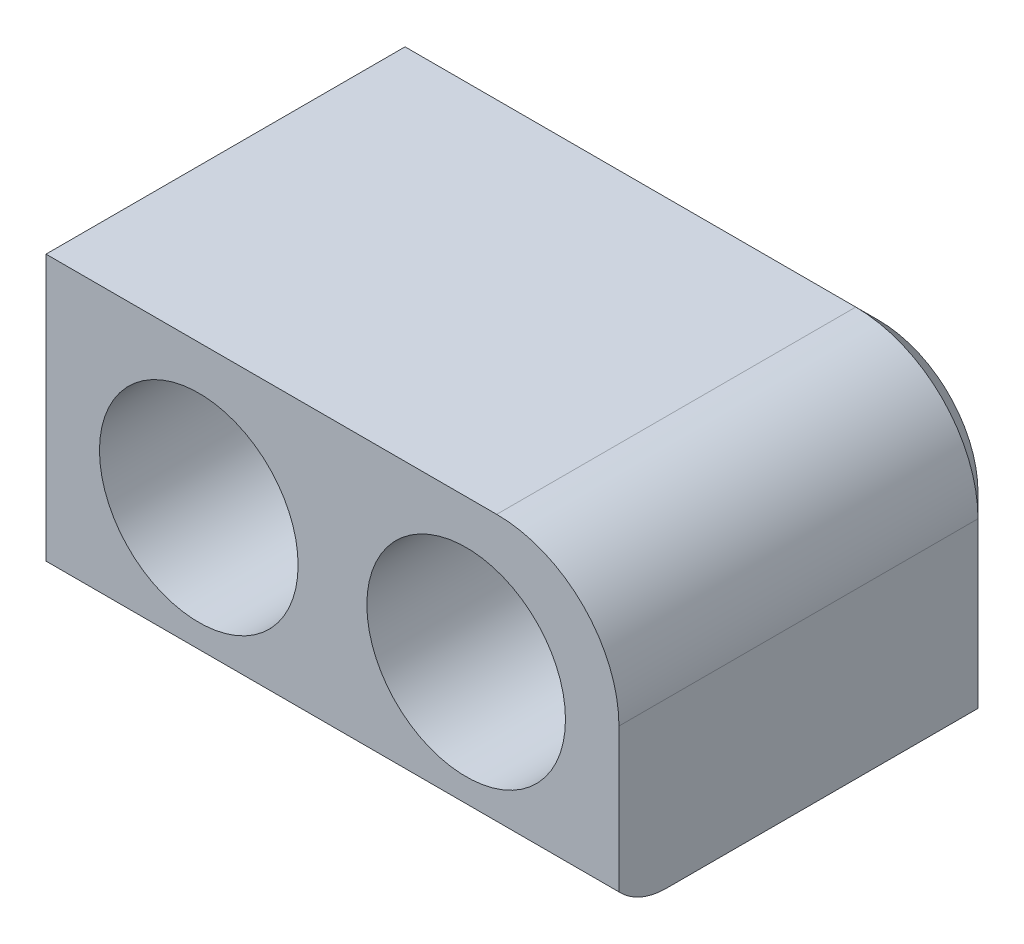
ISO-10303-21;
HEADER;
FILE_DESCRIPTION(('STEP AP214'),'2;1');
FILE_NAME('part.step','',(''),(''),'','','');
FILE_SCHEMA(('AUTOMOTIVE_DESIGN { 1 0 10303 214 1 1 1 1 }'));
ENDSEC;
DATA;
#1=APPLICATION_CONTEXT('core data for automotive mechanical design processes');
#2=APPLICATION_PROTOCOL_DEFINITION('international standard','automotive_design',2000,#1);
#3=PRODUCT_CONTEXT('',#1,'mechanical');
#4=PRODUCT('Part','Part','',(#3));
#5=PRODUCT_RELATED_PRODUCT_CATEGORY('part','',(#4));
#6=PRODUCT_DEFINITION_FORMATION('','',#4);
#7=PRODUCT_DEFINITION_CONTEXT('part definition',#1,'design');
#8=PRODUCT_DEFINITION('design','',#6,#7);
#9=PRODUCT_DEFINITION_SHAPE('','',#8);
#10=(LENGTH_UNIT() NAMED_UNIT(*) SI_UNIT(.MILLI.,.METRE.));
#11=(NAMED_UNIT(*) PLANE_ANGLE_UNIT() SI_UNIT($,.RADIAN.));
#12=(NAMED_UNIT(*) SI_UNIT($,.STERADIAN.) SOLID_ANGLE_UNIT());
#13=UNCERTAINTY_MEASURE_WITH_UNIT(LENGTH_MEASURE(1.E-05),#10,'distance_accuracy_value','');
#14=(GEOMETRIC_REPRESENTATION_CONTEXT(3) GLOBAL_UNCERTAINTY_ASSIGNED_CONTEXT((#13)) GLOBAL_UNIT_ASSIGNED_CONTEXT((#10,
#11,#12)) REPRESENTATION_CONTEXT('',''));
#15=CARTESIAN_POINT('',(0.,0.,0.));
#16=DIRECTION('',(0.,0.,1.));
#17=DIRECTION('',(1.,0.,0.));
#18=AXIS2_PLACEMENT_3D('',#15,#16,#17);
#19=CARTESIAN_POINT('',(0.,9.525,-12.7));
#20=DIRECTION('',(-1.,0.,0.));
#21=DIRECTION('',(0.,-1.,0.));
#22=AXIS2_PLACEMENT_3D('',#19,#20,#21);
#23=PLANE('',#22);
#24=DIRECTION('',(0.,0.,1.));
#25=VECTOR('',#24,1.);
#26=CARTESIAN_POINT('',(0.,9.525,-12.7));
#27=LINE('',#26,#25);
#28=CARTESIAN_POINT('',(0.,9.525,-11.938));
#29=VERTEX_POINT('',#28);
#30=CARTESIAN_POINT('',(0.,9.525,0.));
#31=VERTEX_POINT('',#30);
#32=EDGE_CURVE('E108',#29,#31,#27,.T.);
#33=ORIENTED_EDGE('',*,*,#32,.F.);
#34=DIRECTION('',(0.,-0.707106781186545,-0.70710678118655));
#35=VECTOR('',#34,1.);
#36=CARTESIAN_POINT('',(0.,9.144,-12.319));
#37=LINE('',#36,#35);
#38=CARTESIAN_POINT('',(0.,8.76300000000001,-12.7));
#39=VERTEX_POINT('',#38);
#40=EDGE_CURVE('E174',#29,#39,#37,.T.);
#41=ORIENTED_EDGE('',*,*,#40,.T.);
#42=DIRECTION('',(0.,-1.,0.));
#43=VECTOR('',#42,1.);
#44=CARTESIAN_POINT('',(0.,9.525,-12.7));
#45=LINE('',#44,#43);
#46=CARTESIAN_POINT('',(0.,0.,-12.7));
#47=VERTEX_POINT('',#46);
#48=EDGE_CURVE('E152',#39,#47,#45,.T.);
#49=ORIENTED_EDGE('',*,*,#48,.T.);
#50=DIRECTION('',(0.,0.,1.));
#51=VECTOR('',#50,1.);
#52=CARTESIAN_POINT('',(0.,0.,-12.7));
#53=LINE('',#52,#51);
#54=CARTESIAN_POINT('',(0.,0.,-1.5748));
#55=VERTEX_POINT('',#54);
#56=EDGE_CURVE('E109',#47,#55,#53,.T.);
#57=ORIENTED_EDGE('',*,*,#56,.T.);
#58=CARTESIAN_POINT('',(0.,2.15254971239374,-1.5748));
#59=DIRECTION('',(1.,0.,0.));
#60=DIRECTION('',(0.,-1.,0.));
#61=AXIS2_PLACEMENT_3D('',#58,#59,#60);
#62=CIRCLE('',#61,2.15254971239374);
#63=CARTESIAN_POINT('',(0.,0.685077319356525,0.));
#64=VERTEX_POINT('',#63);
#65=EDGE_CURVE('E116',#64,#55,#62,.T.);
#66=ORIENTED_EDGE('',*,*,#65,.F.);
#67=DIRECTION('',(0.,-1.,0.));
#68=VECTOR('',#67,1.);
#69=CARTESIAN_POINT('',(0.,9.525,0.));
#70=LINE('',#69,#68);
#71=EDGE_CURVE('E151',#31,#64,#70,.T.);
#72=ORIENTED_EDGE('',*,*,#71,.F.);
#73=EDGE_LOOP('',(#33,#41,#49,#57,#66,#72));
#74=FACE_BOUND('',#73,.T.);
#75=ADVANCED_FACE('F37',(#74),#23,.T.);
#76=CARTESIAN_POINT('',(0.,9.525,-12.7));
#77=DIRECTION('',(0.,1.,0.));
#78=DIRECTION('',(0.,0.,1.));
#79=AXIS2_PLACEMENT_3D('',#76,#77,#78);
#80=PLANE('',#79);
#81=DIRECTION('',(0.,0.,1.));
#82=VECTOR('',#81,1.);
#83=CARTESIAN_POINT('',(14.986,9.525,-12.7));
#84=LINE('',#83,#82);
#85=CARTESIAN_POINT('',(14.986,9.525,0.));
#86=VERTEX_POINT('',#85);
#87=CARTESIAN_POINT('',(14.986,9.525,-11.938));
#88=VERTEX_POINT('',#87);
#89=EDGE_CURVE('E168',#86,#88,#84,.F.);
#90=ORIENTED_EDGE('',*,*,#89,.T.);
#91=DIRECTION('',(-1.,0.,0.));
#92=VECTOR('',#91,1.);
#93=CARTESIAN_POINT('',(0.,9.525,-11.938));
#94=LINE('',#93,#92);
#95=EDGE_CURVE('E171',#88,#29,#94,.T.);
#96=ORIENTED_EDGE('',*,*,#95,.T.);
#97=ORIENTED_EDGE('',*,*,#32,.T.);
#98=DIRECTION('',(-1.,0.,0.));
#99=VECTOR('',#98,1.);
#100=CARTESIAN_POINT('',(0.,9.525,0.));
#101=LINE('',#100,#99);
#102=EDGE_CURVE('E155',#86,#31,#101,.T.);
#103=ORIENTED_EDGE('',*,*,#102,.F.);
#104=EDGE_LOOP('',(#90,#96,#97,#103));
#105=FACE_BOUND('',#104,.T.);
#106=ADVANCED_FACE('F207',(#105),#80,.T.);
#107=CARTESIAN_POINT('',(19.05,9.525,-12.7));
#108=DIRECTION('',(1.,0.,0.));
#109=DIRECTION('',(0.,1.,0.));
#110=AXIS2_PLACEMENT_3D('',#107,#108,#109);
#111=PLANE('',#110);
#112=DIRECTION('',(0.,0.,1.));
#113=VECTOR('',#112,1.);
#114=CARTESIAN_POINT('',(19.05,0.,-12.7));
#115=LINE('',#114,#113);
#116=CARTESIAN_POINT('',(19.05,0.,-11.938));
#117=VERTEX_POINT('',#116);
#118=CARTESIAN_POINT('',(19.05,0.,-1.5748));
#119=VERTEX_POINT('',#118);
#120=EDGE_CURVE('E101',#117,#119,#115,.T.);
#121=ORIENTED_EDGE('',*,*,#120,.F.);
#122=DIRECTION('',(0.,1.,0.));
#123=VECTOR('',#122,1.);
#124=CARTESIAN_POINT('',(19.05,5.461,-11.938));
#125=LINE('',#124,#123);
#126=CARTESIAN_POINT('',(19.05,5.461,-11.938));
#127=VERTEX_POINT('',#126);
#128=EDGE_CURVE('E54',#117,#127,#125,.T.);
#129=ORIENTED_EDGE('',*,*,#128,.T.);
#130=DIRECTION('',(0.,0.,1.));
#131=VECTOR('',#130,1.);
#132=CARTESIAN_POINT('',(19.05,5.461,-12.7));
#133=LINE('',#132,#131);
#134=CARTESIAN_POINT('',(19.05,5.461,0.));
#135=VERTEX_POINT('',#134);
#136=EDGE_CURVE('E162',#127,#135,#133,.T.);
#137=ORIENTED_EDGE('',*,*,#136,.T.);
#138=DIRECTION('',(0.,1.,0.));
#139=VECTOR('',#138,1.);
#140=CARTESIAN_POINT('',(19.05,9.525,0.));
#141=LINE('',#140,#139);
#142=CARTESIAN_POINT('',(19.05,0.685077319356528,0.));
#143=VERTEX_POINT('',#142);
#144=EDGE_CURVE('E123',#143,#135,#141,.T.);
#145=ORIENTED_EDGE('',*,*,#144,.F.);
#146=CARTESIAN_POINT('',(19.05,2.15254971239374,-1.5748));
#147=DIRECTION('',(1.,0.,0.));
#148=DIRECTION('',(0.,-1.,0.));
#149=AXIS2_PLACEMENT_3D('',#146,#147,#148);
#150=CIRCLE('',#149,2.15254971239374);
#151=EDGE_CURVE('E113',#143,#119,#150,.T.);
#152=ORIENTED_EDGE('',*,*,#151,.T.);
#153=EDGE_LOOP('',(#121,#129,#137,#145,#152));
#154=FACE_BOUND('',#153,.T.);
#155=ADVANCED_FACE('F121',(#154),#111,.T.);
#156=CARTESIAN_POINT('',(0.,0.,-12.7));
#157=DIRECTION('',(0.,-1.,0.));
#158=DIRECTION('',(0.,0.,-1.));
#159=AXIS2_PLACEMENT_3D('',#156,#157,#158);
#160=PLANE('',#159);
#161=DIRECTION('',(1.,0.,0.));
#162=VECTOR('',#161,1.);
#163=CARTESIAN_POINT('',(0.,0.,-12.7));
#164=LINE('',#163,#162);
#165=CARTESIAN_POINT('',(18.288,0.,-12.7));
#166=VERTEX_POINT('',#165);
#167=EDGE_CURVE('E154',#47,#166,#164,.T.);
#168=ORIENTED_EDGE('',*,*,#167,.T.);
#169=DIRECTION('',(0.707106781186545,0.,0.70710678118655));
#170=VECTOR('',#169,1.);
#171=CARTESIAN_POINT('',(9.14400000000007,0.,-21.844));
#172=LINE('',#171,#170);
#173=EDGE_CURVE('E46',#166,#117,#172,.T.);
#174=ORIENTED_EDGE('',*,*,#173,.T.);
#175=ORIENTED_EDGE('',*,*,#120,.T.);
#176=DIRECTION('',(-1.,0.,0.));
#177=VECTOR('',#176,1.);
#178=CARTESIAN_POINT('',(19.05,0.,-1.5748));
#179=LINE('',#178,#177);
#180=EDGE_CURVE('E105',#119,#55,#179,.T.);
#181=ORIENTED_EDGE('',*,*,#180,.T.);
#182=ORIENTED_EDGE('',*,*,#56,.F.);
#183=EDGE_LOOP('',(#168,#174,#175,#181,#182));
#184=FACE_BOUND('',#183,.T.);
#185=ADVANCED_FACE('F103',(#184),#160,.T.);
#186=CARTESIAN_POINT('',(0.,0.,-12.7));
#187=DIRECTION('',(0.,0.,1.));
#188=DIRECTION('',(1.,0.,0.));
#189=AXIS2_PLACEMENT_3D('',#186,#187,#188);
#190=PLANE('',#189);
#191=ORIENTED_EDGE('',*,*,#48,.F.);
#192=DIRECTION('',(1.,0.,0.));
#193=VECTOR('',#192,1.);
#194=CARTESIAN_POINT('',(14.986,8.76300000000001,-12.7));
#195=LINE('',#194,#193);
#196=CARTESIAN_POINT('',(14.986,8.76300000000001,-12.7));
#197=VERTEX_POINT('',#196);
#198=EDGE_CURVE('E180',#39,#197,#195,.T.);
#199=ORIENTED_EDGE('',*,*,#198,.T.);
#200=CARTESIAN_POINT('',(14.986,5.461,-12.7));
#201=DIRECTION('',(0.,0.,1.));
#202=DIRECTION('',(1.,0.,0.));
#203=AXIS2_PLACEMENT_3D('',#200,#201,#202);
#204=CIRCLE('',#203,3.30200000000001);
#205=CARTESIAN_POINT('',(18.288,5.461,-12.7));
#206=VERTEX_POINT('',#205);
#207=EDGE_CURVE('E176',#197,#206,#204,.F.);
#208=ORIENTED_EDGE('',*,*,#207,.T.);
#209=DIRECTION('',(0.,-1.,0.));
#210=VECTOR('',#209,1.);
#211=CARTESIAN_POINT('',(18.288,0.,-12.7));
#212=LINE('',#211,#210);
#213=EDGE_CURVE('E178',#206,#166,#212,.T.);
#214=ORIENTED_EDGE('',*,*,#213,.T.);
#215=ORIENTED_EDGE('',*,*,#167,.F.);
#216=EDGE_LOOP('',(#191,#199,#208,#214,#215));
#217=FACE_BOUND('',#216,.T.);
#218=CARTESIAN_POINT('',(5.08,4.7625,-12.7));
#219=DIRECTION('',(0.,0.,1.));
#220=DIRECTION('',(1.,0.,0.));
#221=AXIS2_PLACEMENT_3D('',#218,#219,#220);
#222=CIRCLE('',#221,2.159);
#223=CARTESIAN_POINT('',(7.239,4.7625,-12.7));
#224=VERTEX_POINT('',#223);
#225=EDGE_CURVE('E136',#224,#224,#222,.T.);
#226=ORIENTED_EDGE('',*,*,#225,.T.);
#227=EDGE_LOOP('',(#226));
#228=FACE_BOUND('',#227,.T.);
#229=CARTESIAN_POINT('',(13.97,4.7625,-12.7));
#230=DIRECTION('',(0.,0.,1.));
#231=DIRECTION('',(1.,0.,0.));
#232=AXIS2_PLACEMENT_3D('',#229,#230,#231);
#233=CIRCLE('',#232,2.159);
#234=CARTESIAN_POINT('',(16.129,4.7625,-12.7));
#235=VERTEX_POINT('',#234);
#236=EDGE_CURVE('E148',#235,#235,#233,.T.);
#237=ORIENTED_EDGE('',*,*,#236,.T.);
#238=EDGE_LOOP('',(#237));
#239=FACE_BOUND('',#238,.T.);
#240=ADVANCED_FACE('F200',(#217,#228,#239),#190,.F.);
#241=CARTESIAN_POINT('',(0.,0.,0.));
#242=DIRECTION('',(0.,0.,1.));
#243=DIRECTION('',(1.,0.,0.));
#244=AXIS2_PLACEMENT_3D('',#241,#242,#243);
#245=PLANE('',#244);
#246=DIRECTION('',(-1.,0.,0.));
#247=VECTOR('',#246,1.);
#248=CARTESIAN_POINT('',(19.05,0.685077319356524,0.));
#249=LINE('',#248,#247);
#250=EDGE_CURVE('E118',#143,#64,#249,.T.);
#251=ORIENTED_EDGE('',*,*,#250,.F.);
#252=ORIENTED_EDGE('',*,*,#144,.T.);
#253=CARTESIAN_POINT('',(14.986,5.461,0.));
#254=DIRECTION('',(0.,0.,1.));
#255=DIRECTION('',(1.,0.,0.));
#256=AXIS2_PLACEMENT_3D('',#253,#254,#255);
#257=CIRCLE('',#256,4.064);
#258=EDGE_CURVE('E166',#135,#86,#257,.T.);
#259=ORIENTED_EDGE('',*,*,#258,.T.);
#260=ORIENTED_EDGE('',*,*,#102,.T.);
#261=ORIENTED_EDGE('',*,*,#71,.T.);
#262=EDGE_LOOP('',(#251,#252,#259,#260,#261));
#263=FACE_BOUND('',#262,.T.);
#264=CARTESIAN_POINT('',(5.08,4.7625,0.));
#265=DIRECTION('',(0.,0.,1.));
#266=DIRECTION('',(1.,0.,0.));
#267=AXIS2_PLACEMENT_3D('',#264,#265,#266);
#268=CIRCLE('',#267,3.302);
#269=CARTESIAN_POINT('',(8.382,4.7625,0.));
#270=VERTEX_POINT('',#269);
#271=EDGE_CURVE('E117',#270,#270,#268,.T.);
#272=ORIENTED_EDGE('',*,*,#271,.F.);
#273=EDGE_LOOP('',(#272));
#274=FACE_BOUND('',#273,.T.);
#275=CARTESIAN_POINT('',(13.97,4.7625,0.));
#276=DIRECTION('',(0.,0.,1.));
#277=DIRECTION('',(1.,0.,0.));
#278=AXIS2_PLACEMENT_3D('',#275,#276,#277);
#279=CIRCLE('',#278,3.302);
#280=CARTESIAN_POINT('',(17.272,4.7625,0.));
#281=VERTEX_POINT('',#280);
#282=EDGE_CURVE('E139',#281,#281,#279,.T.);
#283=ORIENTED_EDGE('',*,*,#282,.F.);
#284=EDGE_LOOP('',(#283));
#285=FACE_BOUND('',#284,.T.);
#286=ADVANCED_FACE('F211',(#263,#274,#285),#245,.T.);
#287=CARTESIAN_POINT('',(14.986,5.461,-12.7));
#288=DIRECTION('',(0.,0.,1.));
#289=DIRECTION('',(1.,0.,0.));
#290=AXIS2_PLACEMENT_3D('',#287,#288,#289);
#291=CYLINDRICAL_SURFACE('',#290,4.064);
#292=ORIENTED_EDGE('',*,*,#136,.F.);
#293=CARTESIAN_POINT('',(14.986,5.461,-11.938));
#294=DIRECTION('',(0.,0.,1.));
#295=DIRECTION('',(1.,0.,0.));
#296=AXIS2_PLACEMENT_3D('',#293,#294,#295);
#297=CIRCLE('',#296,4.064);
#298=EDGE_CURVE('E11',#127,#88,#297,.T.);
#299=ORIENTED_EDGE('',*,*,#298,.T.);
#300=ORIENTED_EDGE('',*,*,#89,.F.);
#301=ORIENTED_EDGE('',*,*,#258,.F.);
#302=EDGE_LOOP('',(#292,#299,#300,#301));
#303=FACE_BOUND('',#302,.T.);
#304=ADVANCED_FACE('F215',(#303),#291,.T.);
#305=CARTESIAN_POINT('',(13.97,4.7625,0.));
#306=DIRECTION('',(0.,0.,1.));
#307=DIRECTION('',(1.,0.,0.));
#308=AXIS2_PLACEMENT_3D('',#305,#306,#307);
#309=CYLINDRICAL_SURFACE('',#308,2.159);
#310=ORIENTED_EDGE('',*,*,#236,.F.);
#311=EDGE_LOOP('',(#310));
#312=FACE_BOUND('',#311,.T.);
#313=CARTESIAN_POINT('',(13.97,4.7625,-4.826));
#314=DIRECTION('',(0.,0.,1.));
#315=DIRECTION('',(1.,0.,0.));
#316=AXIS2_PLACEMENT_3D('',#313,#314,#315);
#317=CIRCLE('',#316,2.159);
#318=CARTESIAN_POINT('',(16.129,4.7625,-4.826));
#319=VERTEX_POINT('',#318);
#320=EDGE_CURVE('E145',#319,#319,#317,.T.);
#321=ORIENTED_EDGE('',*,*,#320,.T.);
#322=EDGE_LOOP('',(#321));
#323=FACE_BOUND('',#322,.T.);
#324=ADVANCED_FACE('F217',(#312,#323),#309,.F.);
#325=CARTESIAN_POINT('',(16.129,4.7625,-4.826));
#326=DIRECTION('',(0.,0.,-1.));
#327=DIRECTION('',(-1.,0.,0.));
#328=AXIS2_PLACEMENT_3D('',#325,#326,#327);
#329=PLANE('',#328);
#330=ORIENTED_EDGE('',*,*,#320,.F.);
#331=EDGE_LOOP('',(#330));
#332=FACE_BOUND('',#331,.T.);
#333=CARTESIAN_POINT('',(13.97,4.7625,-4.826));
#334=DIRECTION('',(0.,0.,1.));
#335=DIRECTION('',(1.,0.,0.));
#336=AXIS2_PLACEMENT_3D('',#333,#334,#335);
#337=CIRCLE('',#336,3.302);
#338=CARTESIAN_POINT('',(17.272,4.7625,-4.826));
#339=VERTEX_POINT('',#338);
#340=EDGE_CURVE('E142',#339,#339,#337,.T.);
#341=ORIENTED_EDGE('',*,*,#340,.T.);
#342=EDGE_LOOP('',(#341));
#343=FACE_BOUND('',#342,.T.);
#344=ADVANCED_FACE('F223',(#332,#343),#329,.F.);
#345=CARTESIAN_POINT('',(13.97,4.7625,0.));
#346=DIRECTION('',(0.,0.,1.));
#347=DIRECTION('',(1.,0.,0.));
#348=AXIS2_PLACEMENT_3D('',#345,#346,#347);
#349=CYLINDRICAL_SURFACE('',#348,3.302);
#350=ORIENTED_EDGE('',*,*,#340,.F.);
#351=EDGE_LOOP('',(#350));
#352=FACE_BOUND('',#351,.T.);
#353=ORIENTED_EDGE('',*,*,#282,.T.);
#354=EDGE_LOOP('',(#353));
#355=FACE_BOUND('',#354,.T.);
#356=ADVANCED_FACE('F243',(#352,#355),#349,.F.);
#357=CARTESIAN_POINT('',(5.08,4.7625,0.));
#358=DIRECTION('',(0.,0.,1.));
#359=DIRECTION('',(1.,0.,0.));
#360=AXIS2_PLACEMENT_3D('',#357,#358,#359);
#361=CYLINDRICAL_SURFACE('',#360,2.159);
#362=ORIENTED_EDGE('',*,*,#225,.F.);
#363=EDGE_LOOP('',(#362));
#364=FACE_BOUND('',#363,.T.);
#365=CARTESIAN_POINT('',(5.08,4.7625,-4.826));
#366=DIRECTION('',(0.,0.,1.));
#367=DIRECTION('',(1.,0.,0.));
#368=AXIS2_PLACEMENT_3D('',#365,#366,#367);
#369=CIRCLE('',#368,2.159);
#370=CARTESIAN_POINT('',(7.239,4.7625,-4.826));
#371=VERTEX_POINT('',#370);
#372=EDGE_CURVE('E133',#371,#371,#369,.T.);
#373=ORIENTED_EDGE('',*,*,#372,.T.);
#374=EDGE_LOOP('',(#373));
#375=FACE_BOUND('',#374,.T.);
#376=ADVANCED_FACE('F247',(#364,#375),#361,.F.);
#377=CARTESIAN_POINT('',(7.239,4.7625,-4.826));
#378=DIRECTION('',(0.,0.,-1.));
#379=DIRECTION('',(-1.,0.,0.));
#380=AXIS2_PLACEMENT_3D('',#377,#378,#379);
#381=PLANE('',#380);
#382=ORIENTED_EDGE('',*,*,#372,.F.);
#383=EDGE_LOOP('',(#382));
#384=FACE_BOUND('',#383,.T.);
#385=CARTESIAN_POINT('',(5.08,4.7625,-4.826));
#386=DIRECTION('',(0.,0.,1.));
#387=DIRECTION('',(1.,0.,0.));
#388=AXIS2_PLACEMENT_3D('',#385,#386,#387);
#389=CIRCLE('',#388,3.302);
#390=CARTESIAN_POINT('',(8.382,4.7625,-4.826));
#391=VERTEX_POINT('',#390);
#392=EDGE_CURVE('E130',#391,#391,#389,.T.);
#393=ORIENTED_EDGE('',*,*,#392,.T.);
#394=EDGE_LOOP('',(#393));
#395=FACE_BOUND('',#394,.T.);
#396=ADVANCED_FACE('F251',(#384,#395),#381,.F.);
#397=CARTESIAN_POINT('',(5.08,4.7625,0.));
#398=DIRECTION('',(0.,0.,1.));
#399=DIRECTION('',(1.,0.,0.));
#400=AXIS2_PLACEMENT_3D('',#397,#398,#399);
#401=CYLINDRICAL_SURFACE('',#400,3.302);
#402=ORIENTED_EDGE('',*,*,#392,.F.);
#403=EDGE_LOOP('',(#402));
#404=FACE_BOUND('',#403,.T.);
#405=ORIENTED_EDGE('',*,*,#271,.T.);
#406=EDGE_LOOP('',(#405));
#407=FACE_BOUND('',#406,.T.);
#408=ADVANCED_FACE('F255',(#404,#407),#401,.F.);
#409=CARTESIAN_POINT('',(19.05,2.15254971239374,-1.5748));
#410=DIRECTION('',(-1.,0.,0.));
#411=DIRECTION('',(0.,-1.,0.));
#412=AXIS2_PLACEMENT_3D('',#409,#410,#411);
#413=CYLINDRICAL_SURFACE('',#412,2.15254971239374);
#414=ORIENTED_EDGE('',*,*,#65,.T.);
#415=ORIENTED_EDGE('',*,*,#180,.F.);
#416=ORIENTED_EDGE('',*,*,#151,.F.);
#417=ORIENTED_EDGE('',*,*,#250,.T.);
#418=EDGE_LOOP('',(#414,#415,#416,#417));
#419=FACE_BOUND('',#418,.T.);
#420=ADVANCED_FACE('F112',(#419),#413,.T.);
#421=CARTESIAN_POINT('',(19.05,9.525,-11.938));
#422=DIRECTION('',(0.70710678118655,0.,-0.707106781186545));
#423=DIRECTION('',(0.,-1.,0.));
#424=AXIS2_PLACEMENT_3D('',#421,#422,#423);
#425=PLANE('',#424);
#426=ORIENTED_EDGE('',*,*,#173,.F.);
#427=ORIENTED_EDGE('',*,*,#213,.F.);
#428=DIRECTION('',(-0.707106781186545,0.,-0.70710678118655));
#429=VECTOR('',#428,1.);
#430=CARTESIAN_POINT('',(19.05,5.461,-11.938));
#431=LINE('',#430,#429);
#432=EDGE_CURVE('E41',#127,#206,#431,.T.);
#433=ORIENTED_EDGE('',*,*,#432,.F.);
#434=ORIENTED_EDGE('',*,*,#128,.F.);
#435=EDGE_LOOP('',(#426,#427,#433,#434));
#436=FACE_BOUND('',#435,.T.);
#437=ADVANCED_FACE('F39',(#436),#425,.T.);
#438=CARTESIAN_POINT('',(14.986,5.461,-12.7));
#439=DIRECTION('',(0.,0.,1.));
#440=DIRECTION('',(1.,0.,0.));
#441=AXIS2_PLACEMENT_3D('',#438,#439,#440);
#442=CONICAL_SURFACE('',#441,3.30200000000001,0.785398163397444);
#443=ORIENTED_EDGE('',*,*,#432,.T.);
#444=ORIENTED_EDGE('',*,*,#207,.F.);
#445=DIRECTION('',(0.,-0.707106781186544,-0.707106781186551));
#446=VECTOR('',#445,1.);
#447=CARTESIAN_POINT('',(14.986,9.525,-11.938));
#448=LINE('',#447,#446);
#449=EDGE_CURVE('E183',#88,#197,#448,.T.);
#450=ORIENTED_EDGE('',*,*,#449,.F.);
#451=ORIENTED_EDGE('',*,*,#298,.F.);
#452=EDGE_LOOP('',(#443,#444,#450,#451));
#453=FACE_BOUND('',#452,.T.);
#454=ADVANCED_FACE('F194',(#453),#442,.T.);
#455=CARTESIAN_POINT('',(0.,9.525,-11.938));
#456=DIRECTION('',(0.,0.70710678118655,-0.707106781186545));
#457=DIRECTION('',(1.,0.,0.));
#458=AXIS2_PLACEMENT_3D('',#455,#456,#457);
#459=PLANE('',#458);
#460=ORIENTED_EDGE('',*,*,#449,.T.);
#461=ORIENTED_EDGE('',*,*,#198,.F.);
#462=ORIENTED_EDGE('',*,*,#40,.F.);
#463=ORIENTED_EDGE('',*,*,#95,.F.);
#464=EDGE_LOOP('',(#460,#461,#462,#463));
#465=FACE_BOUND('',#464,.T.);
#466=ADVANCED_FACE('F205',(#465),#459,.T.);
#467=CLOSED_SHELL('',(#75,#106,#155,#185,#240,#286,#304,#324,#344,#356,#376,#396,#408,#420,#437,
#454,#466));
#468=MANIFOLD_SOLID_BREP('B2',#467);
#469=ADVANCED_BREP_SHAPE_REPRESENTATION('',(#18,#468),#14);
#470=SHAPE_DEFINITION_REPRESENTATION(#9,#469);
ENDSEC;
END-ISO-10303-21;
